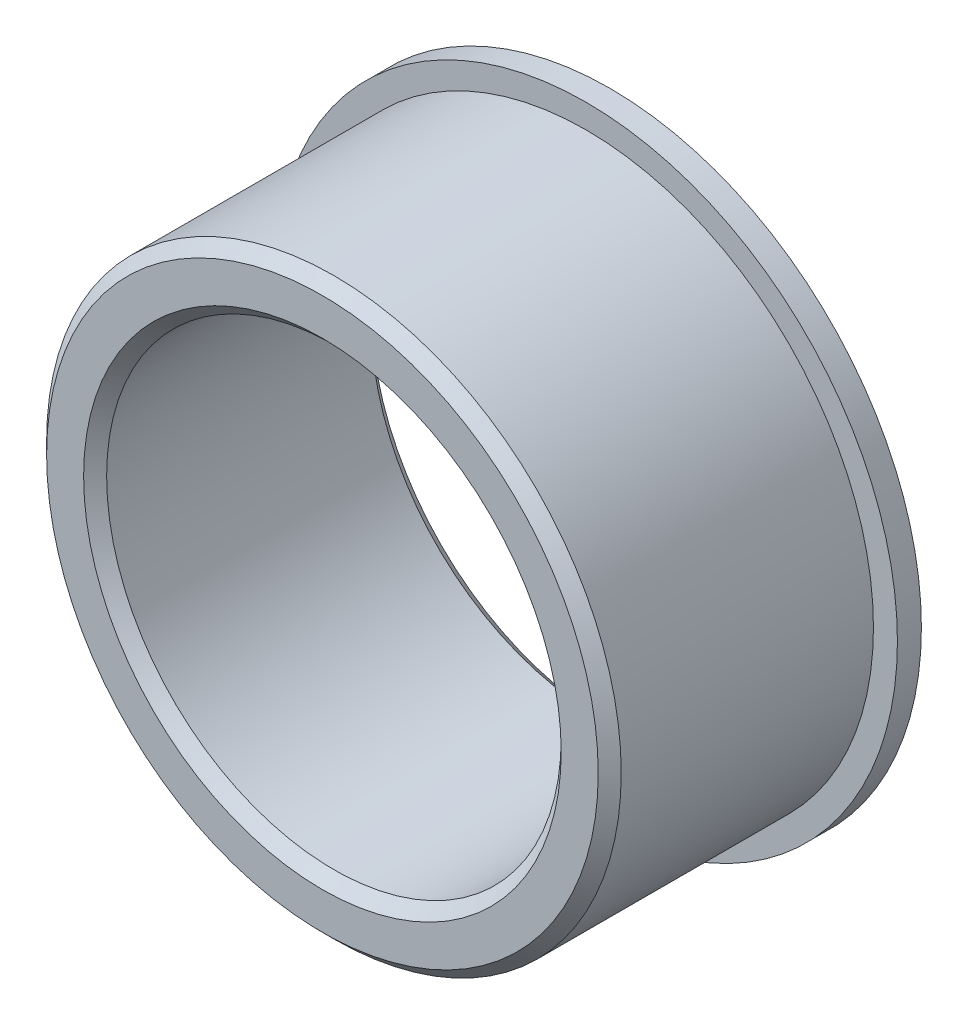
ISO-10303-21;
HEADER;
FILE_DESCRIPTION(('STEP AP214'),'2;1');
FILE_NAME('part.step','',(''),(''),'','','');
FILE_SCHEMA(('AUTOMOTIVE_DESIGN { 1 0 10303 214 1 1 1 1 }'));
ENDSEC;
DATA;
#1=APPLICATION_CONTEXT('core data for automotive mechanical design processes');
#2=APPLICATION_PROTOCOL_DEFINITION('international standard','automotive_design',2000,#1);
#3=PRODUCT_CONTEXT('',#1,'mechanical');
#4=PRODUCT('Part','Part','',(#3));
#5=PRODUCT_RELATED_PRODUCT_CATEGORY('part','',(#4));
#6=PRODUCT_DEFINITION_FORMATION('','',#4);
#7=PRODUCT_DEFINITION_CONTEXT('part definition',#1,'design');
#8=PRODUCT_DEFINITION('design','',#6,#7);
#9=PRODUCT_DEFINITION_SHAPE('','',#8);
#10=(LENGTH_UNIT() NAMED_UNIT(*) SI_UNIT(.MILLI.,.METRE.));
#11=(NAMED_UNIT(*) PLANE_ANGLE_UNIT() SI_UNIT($,.RADIAN.));
#12=(NAMED_UNIT(*) SI_UNIT($,.STERADIAN.) SOLID_ANGLE_UNIT());
#13=UNCERTAINTY_MEASURE_WITH_UNIT(LENGTH_MEASURE(1.E-05),#10,'distance_accuracy_value','');
#14=(GEOMETRIC_REPRESENTATION_CONTEXT(3) GLOBAL_UNCERTAINTY_ASSIGNED_CONTEXT((#13)) GLOBAL_UNIT_ASSIGNED_CONTEXT((#10,
#11,#12)) REPRESENTATION_CONTEXT('',''));
#15=CARTESIAN_POINT('',(0.,0.,0.));
#16=DIRECTION('',(0.,0.,1.));
#17=DIRECTION('',(1.,0.,0.));
#18=AXIS2_PLACEMENT_3D('',#15,#16,#17);
#19=CARTESIAN_POINT('',(0.,20.6125,-19.05));
#20=DIRECTION('',(0.,0.,1.));
#21=DIRECTION('',(1.,0.,0.));
#22=AXIS2_PLACEMENT_3D('',#19,#20,#21);
#23=PLANE('',#22);
#24=CARTESIAN_POINT('',(0.,0.,-19.05));
#25=DIRECTION('',(0.,0.,1.));
#26=DIRECTION('',(1.,0.,0.));
#27=AXIS2_PLACEMENT_3D('',#24,#25,#26);
#28=CIRCLE('',#27,15.812);
#29=CARTESIAN_POINT('',(15.812,0.,-19.05));
#30=VERTEX_POINT('',#29);
#31=EDGE_CURVE('E57',#30,#30,#28,.T.);
#32=ORIENTED_EDGE('',*,*,#31,.T.);
#33=EDGE_LOOP('',(#32));
#34=FACE_BOUND('',#33,.T.);
#35=CARTESIAN_POINT('',(0.,0.,-19.05));
#36=DIRECTION('',(0.,0.,1.));
#37=DIRECTION('',(1.,0.,0.));
#38=AXIS2_PLACEMENT_3D('',#35,#36,#37);
#39=CIRCLE('',#38,20.6125);
#40=CARTESIAN_POINT('',(20.6125,0.,-19.05));
#41=VERTEX_POINT('',#40);
#42=EDGE_CURVE('E60',#41,#41,#39,.T.);
#43=ORIENTED_EDGE('',*,*,#42,.F.);
#44=EDGE_LOOP('',(#43));
#45=FACE_BOUND('',#44,.T.);
#46=ADVANCED_FACE('F34',(#34,#45),#23,.F.);
#47=CARTESIAN_POINT('',(0.,0.,0.));
#48=DIRECTION('',(0.,0.,1.));
#49=DIRECTION('',(1.,0.,0.));
#50=AXIS2_PLACEMENT_3D('',#47,#48,#49);
#51=CYLINDRICAL_SURFACE('',#50,20.6125);
#52=CARTESIAN_POINT('',(0.,0.,-17.4625));
#53=DIRECTION('',(0.,0.,1.));
#54=DIRECTION('',(1.,0.,0.));
#55=AXIS2_PLACEMENT_3D('',#52,#53,#54);
#56=CIRCLE('',#55,20.6125);
#57=CARTESIAN_POINT('',(20.6125,0.,-17.4625));
#58=VERTEX_POINT('',#57);
#59=EDGE_CURVE('E63',#58,#58,#56,.T.);
#60=ORIENTED_EDGE('',*,*,#59,.F.);
#61=EDGE_LOOP('',(#60));
#62=FACE_BOUND('',#61,.T.);
#63=ORIENTED_EDGE('',*,*,#42,.T.);
#64=EDGE_LOOP('',(#63));
#65=FACE_BOUND('',#64,.T.);
#66=ADVANCED_FACE('F75',(#62,#65),#51,.T.);
#67=CARTESIAN_POINT('',(0.,20.6125,-17.4625));
#68=DIRECTION('',(0.,0.,-1.));
#69=DIRECTION('',(-1.,0.,0.));
#70=AXIS2_PLACEMENT_3D('',#67,#68,#69);
#71=PLANE('',#70);
#72=CARTESIAN_POINT('',(0.,0.,-17.4625));
#73=DIRECTION('',(0.,0.,1.));
#74=DIRECTION('',(1.,0.,0.));
#75=AXIS2_PLACEMENT_3D('',#72,#73,#74);
#76=CIRCLE('',#75,19.025);
#77=CARTESIAN_POINT('',(19.025,0.,-17.4625));
#78=VERTEX_POINT('',#77);
#79=EDGE_CURVE('E66',#78,#78,#76,.T.);
#80=ORIENTED_EDGE('',*,*,#79,.F.);
#81=EDGE_LOOP('',(#80));
#82=FACE_BOUND('',#81,.T.);
#83=ORIENTED_EDGE('',*,*,#59,.T.);
#84=EDGE_LOOP('',(#83));
#85=FACE_BOUND('',#84,.T.);
#86=ADVANCED_FACE('F72',(#82,#85),#71,.F.);
#87=CARTESIAN_POINT('',(0.,0.,0.));
#88=DIRECTION('',(0.,0.,1.));
#89=DIRECTION('',(1.,0.,0.));
#90=AXIS2_PLACEMENT_3D('',#87,#88,#89);
#91=CYLINDRICAL_SURFACE('',#90,19.025);
#92=CARTESIAN_POINT('',(0.,0.,-0.762000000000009));
#93=DIRECTION('',(0.,0.,-1.));
#94=DIRECTION('',(-1.,0.,0.));
#95=AXIS2_PLACEMENT_3D('',#92,#93,#94);
#96=CIRCLE('',#95,19.025);
#97=CARTESIAN_POINT('',(-19.025,0.,-0.762000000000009));
#98=VERTEX_POINT('',#97);
#99=EDGE_CURVE('E10',#98,#98,#96,.T.);
#100=ORIENTED_EDGE('',*,*,#99,.T.);
#101=EDGE_LOOP('',(#100));
#102=FACE_BOUND('',#101,.T.);
#103=ORIENTED_EDGE('',*,*,#79,.T.);
#104=EDGE_LOOP('',(#103));
#105=FACE_BOUND('',#104,.T.);
#106=ADVANCED_FACE('F70',(#102,#105),#91,.T.);
#107=CARTESIAN_POINT('',(0.,19.025,0.));
#108=DIRECTION('',(0.,0.,-1.));
#109=DIRECTION('',(-1.,0.,0.));
#110=AXIS2_PLACEMENT_3D('',#107,#108,#109);
#111=PLANE('',#110);
#112=CARTESIAN_POINT('',(0.,0.,0.));
#113=DIRECTION('',(0.,0.,-1.));
#114=DIRECTION('',(-1.,0.,0.));
#115=AXIS2_PLACEMENT_3D('',#112,#113,#114);
#116=CIRCLE('',#115,15.812);
#117=CARTESIAN_POINT('',(15.812,0.,0.));
#118=VERTEX_POINT('',#117);
#119=EDGE_CURVE('E41',#118,#118,#116,.T.);
#120=ORIENTED_EDGE('',*,*,#119,.T.);
#121=EDGE_LOOP('',(#120));
#122=FACE_BOUND('',#121,.T.);
#123=CARTESIAN_POINT('',(0.,0.,0.));
#124=DIRECTION('',(0.,0.,-1.));
#125=DIRECTION('',(-1.,0.,0.));
#126=AXIS2_PLACEMENT_3D('',#123,#124,#125);
#127=CIRCLE('',#126,18.263);
#128=CARTESIAN_POINT('',(-18.263,0.,0.));
#129=VERTEX_POINT('',#128);
#130=EDGE_CURVE('E45',#129,#129,#127,.F.);
#131=ORIENTED_EDGE('',*,*,#130,.T.);
#132=EDGE_LOOP('',(#131));
#133=FACE_BOUND('',#132,.T.);
#134=ADVANCED_FACE('F105',(#122,#133),#111,.F.);
#135=CARTESIAN_POINT('',(0.,0.,0.));
#136=DIRECTION('',(0.,0.,1.));
#137=DIRECTION('',(1.,0.,0.));
#138=AXIS2_PLACEMENT_3D('',#135,#136,#137);
#139=CYLINDRICAL_SURFACE('',#138,15.05);
#140=CARTESIAN_POINT('',(0.,0.,-18.288));
#141=DIRECTION('',(0.,0.,1.));
#142=DIRECTION('',(1.,0.,0.));
#143=AXIS2_PLACEMENT_3D('',#140,#141,#142);
#144=CIRCLE('',#143,15.05);
#145=CARTESIAN_POINT('',(15.05,0.,-18.288));
#146=VERTEX_POINT('',#145);
#147=EDGE_CURVE('E49',#146,#146,#144,.F.);
#148=ORIENTED_EDGE('',*,*,#147,.T.);
#149=EDGE_LOOP('',(#148));
#150=FACE_BOUND('',#149,.T.);
#151=CARTESIAN_POINT('',(0.,0.,-0.762000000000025));
#152=DIRECTION('',(0.,0.,-1.));
#153=DIRECTION('',(-1.,0.,0.));
#154=AXIS2_PLACEMENT_3D('',#151,#152,#153);
#155=CIRCLE('',#154,15.05);
#156=CARTESIAN_POINT('',(15.05,0.,-0.762000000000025));
#157=VERTEX_POINT('',#156);
#158=EDGE_CURVE('E54',#157,#157,#155,.F.);
#159=ORIENTED_EDGE('',*,*,#158,.T.);
#160=EDGE_LOOP('',(#159));
#161=FACE_BOUND('',#160,.T.);
#162=ADVANCED_FACE('F93',(#150,#161),#139,.F.);
#163=CARTESIAN_POINT('',(0.,0.,-19.05));
#164=DIRECTION('',(0.,0.,-1.));
#165=DIRECTION('',(-1.,0.,0.));
#166=AXIS2_PLACEMENT_3D('',#163,#164,#165);
#167=CONICAL_SURFACE('',#166,15.812,0.785398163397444);
#168=ORIENTED_EDGE('',*,*,#147,.F.);
#169=EDGE_LOOP('',(#168));
#170=FACE_BOUND('',#169,.T.);
#171=ORIENTED_EDGE('',*,*,#31,.F.);
#172=EDGE_LOOP('',(#171));
#173=FACE_BOUND('',#172,.T.);
#174=ADVANCED_FACE('F90',(#170,#173),#167,.F.);
#175=CARTESIAN_POINT('',(0.,0.,-0.762000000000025));
#176=DIRECTION('',(0.,0.,1.));
#177=DIRECTION('',(1.,0.,0.));
#178=AXIS2_PLACEMENT_3D('',#175,#176,#177);
#179=CONICAL_SURFACE('',#178,15.05,0.785398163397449);
#180=CARTESIAN_POINT('',(15.812,0.,0.));
#181=CARTESIAN_POINT('',(15.8040625,0.,-0.00793750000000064));
#182=CARTESIAN_POINT('',(15.796125,0.,-0.0158750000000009));
#183=CARTESIAN_POINT('',(15.78025,0.,-0.0317500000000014));
#184=CARTESIAN_POINT('',(15.7723125,0.,-0.0396875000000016));
#185=CARTESIAN_POINT('',(15.7564375,0.,-0.0555625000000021));
#186=CARTESIAN_POINT('',(15.7485,0.,-0.0635000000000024));
#187=CARTESIAN_POINT('',(15.732625,0.,-0.0793750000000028));
#188=CARTESIAN_POINT('',(15.7246875,0.,-0.0873125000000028));
#189=CARTESIAN_POINT('',(15.7088125,0.,-0.103187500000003));
#190=CARTESIAN_POINT('',(15.700875,0.,-0.111125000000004));
#191=CARTESIAN_POINT('',(15.685,0.,-0.127000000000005));
#192=CARTESIAN_POINT('',(15.6770625,0.,-0.134937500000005));
#193=CARTESIAN_POINT('',(15.6611875,0.,-0.150812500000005));
#194=CARTESIAN_POINT('',(15.65325,0.,-0.158750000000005));
#195=CARTESIAN_POINT('',(15.637375,0.,-0.174625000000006));
#196=CARTESIAN_POINT('',(15.6294375,0.,-0.182562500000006));
#197=CARTESIAN_POINT('',(15.6135625,0.,-0.198437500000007));
#198=CARTESIAN_POINT('',(15.605625,0.,-0.206375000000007));
#199=CARTESIAN_POINT('',(15.58975,0.,-0.222250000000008));
#200=CARTESIAN_POINT('',(15.5818125,0.,-0.230187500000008));
#201=CARTESIAN_POINT('',(15.5659375,0.,-0.246062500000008));
#202=CARTESIAN_POINT('',(15.558,0.,-0.254000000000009));
#203=CARTESIAN_POINT('',(15.542125,0.,-0.269875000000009));
#204=CARTESIAN_POINT('',(15.5341875,0.,-0.277812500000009));
#205=CARTESIAN_POINT('',(15.5183125,0.,-0.29368750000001));
#206=CARTESIAN_POINT('',(15.510375,0.,-0.30162500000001));
#207=CARTESIAN_POINT('',(15.4945,0.,-0.317500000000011));
#208=CARTESIAN_POINT('',(15.4865625,0.,-0.325437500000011));
#209=CARTESIAN_POINT('',(15.4706875,0.,-0.341312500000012));
#210=CARTESIAN_POINT('',(15.46275,0.,-0.349250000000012));
#211=CARTESIAN_POINT('',(15.446875,0.,-0.365125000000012));
#212=CARTESIAN_POINT('',(15.4389375,0.,-0.373062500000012));
#213=CARTESIAN_POINT('',(15.4230625,0.,-0.388937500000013));
#214=CARTESIAN_POINT('',(15.415125,0.,-0.396875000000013));
#215=CARTESIAN_POINT('',(15.39925,0.,-0.412750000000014));
#216=CARTESIAN_POINT('',(15.3913125,0.,-0.420687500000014));
#217=CARTESIAN_POINT('',(15.3754375,0.,-0.436562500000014));
#218=CARTESIAN_POINT('',(15.3675,0.,-0.444500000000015));
#219=CARTESIAN_POINT('',(15.351625,0.,-0.460375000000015));
#220=CARTESIAN_POINT('',(15.3436875,0.,-0.468312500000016));
#221=CARTESIAN_POINT('',(15.3278125,0.,-0.484187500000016));
#222=CARTESIAN_POINT('',(15.319875,0.,-0.492125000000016));
#223=CARTESIAN_POINT('',(15.304,0.,-0.508000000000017));
#224=CARTESIAN_POINT('',(15.2960625,0.,-0.515937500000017));
#225=CARTESIAN_POINT('',(15.2801875,0.,-0.531812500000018));
#226=CARTESIAN_POINT('',(15.27225,0.,-0.539750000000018));
#227=CARTESIAN_POINT('',(15.256375,0.,-0.555625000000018));
#228=CARTESIAN_POINT('',(15.2484375,0.,-0.563562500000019));
#229=CARTESIAN_POINT('',(15.2325625,0.,-0.579437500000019));
#230=CARTESIAN_POINT('',(15.224625,0.,-0.587375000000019));
#231=CARTESIAN_POINT('',(15.20875,0.,-0.60325000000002));
#232=CARTESIAN_POINT('',(15.2008125,0.,-0.61118750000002));
#233=CARTESIAN_POINT('',(15.1849375,0.,-0.627062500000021));
#234=CARTESIAN_POINT('',(15.177,0.,-0.635000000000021));
#235=CARTESIAN_POINT('',(15.161125,0.,-0.650875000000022));
#236=CARTESIAN_POINT('',(15.1531875,0.,-0.658812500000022));
#237=CARTESIAN_POINT('',(15.1373125,0.,-0.674687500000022));
#238=CARTESIAN_POINT('',(15.129375,0.,-0.682625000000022));
#239=CARTESIAN_POINT('',(15.1135,0.,-0.698500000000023));
#240=CARTESIAN_POINT('',(15.1055625,0.,-0.706437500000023));
#241=CARTESIAN_POINT('',(15.0896875,0.,-0.722312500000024));
#242=CARTESIAN_POINT('',(15.08175,0.,-0.730250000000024));
#243=CARTESIAN_POINT('',(15.065875,0.,-0.746125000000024));
#244=CARTESIAN_POINT('',(15.0579375,0.,-0.754062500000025));
#245=CARTESIAN_POINT('',(15.05,0.,-0.762000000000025));
#246=B_SPLINE_CURVE_WITH_KNOTS('',3,(#180,#181,#182,#183,#184,#185,#186,#187,#188,#189,#190,
#191,#192,#193,#194,#195,#196,#197,#198,#199,#200,#201,#202,#203,#204,#205,#206,#207,#208,#209,
#210,#211,#212,#213,#214,#215,#216,#217,#218,#219,#220,#221,#222,#223,#224,#225,#226,#227,#228,
#229,#230,#231,#232,#233,#234,#235,#236,#237,#238,#239,#240,#241,#242,#243,#244,#245),
.UNSPECIFIED.,.F.,.F.,(4,2,2,2,2,2,2,2,2,2,2,2,2,2,2,2,2,2,2,2,2,2,2,2,2,2,2,2,2,2,2,2,4),(0.,
0.0336759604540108,0.0673519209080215,0.101027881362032,0.134703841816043,0.168379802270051,
0.202055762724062,0.235731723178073,0.269407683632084,0.303083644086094,0.336759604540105,
0.370435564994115,0.404111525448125,0.437787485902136,0.471463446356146,0.505139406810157,
0.538815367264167,0.572491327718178,0.606167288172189,0.639843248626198,0.673519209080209,
0.70719516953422,0.740871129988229,0.77454709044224,0.808223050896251,0.841899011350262,
0.875574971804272,0.909250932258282,0.942926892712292,0.976602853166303,1.01027881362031,
1.04395477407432,1.07763073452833),.UNSPECIFIED.);
#247=EDGE_CURVE('BSEAM92',#118,#157,#246,.T.);
#248=ORIENTED_EDGE('',*,*,#119,.F.);
#249=ORIENTED_EDGE('',*,*,#158,.F.);
#250=ORIENTED_EDGE('',*,*,#247,.T.);
#251=ORIENTED_EDGE('',*,*,#247,.F.);
#252=EDGE_LOOP('',(#248,#250,#249,#251));
#253=FACE_BOUND('',#252,.T.);
#254=ADVANCED_FACE('F92',(#253),#179,.F.);
#255=CARTESIAN_POINT('',(0.,0.,0.));
#256=DIRECTION('',(0.,0.,-1.));
#257=DIRECTION('',(-1.,0.,0.));
#258=AXIS2_PLACEMENT_3D('',#255,#256,#257);
#259=CONICAL_SURFACE('',#258,18.263,0.785398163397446);
#260=ORIENTED_EDGE('',*,*,#99,.F.);
#261=EDGE_LOOP('',(#260));
#262=FACE_BOUND('',#261,.T.);
#263=ORIENTED_EDGE('',*,*,#130,.F.);
#264=EDGE_LOOP('',(#263));
#265=FACE_BOUND('',#264,.T.);
#266=ADVANCED_FACE('F36',(#262,#265),#259,.T.);
#267=CLOSED_SHELL('',(#46,#66,#86,#106,#134,#162,#174,#254,#266));
#268=MANIFOLD_SOLID_BREP('B2',#267);
#269=ADVANCED_BREP_SHAPE_REPRESENTATION('',(#18,#268),#14);
#270=SHAPE_DEFINITION_REPRESENTATION(#9,#269);
ENDSEC;
END-ISO-10303-21;
